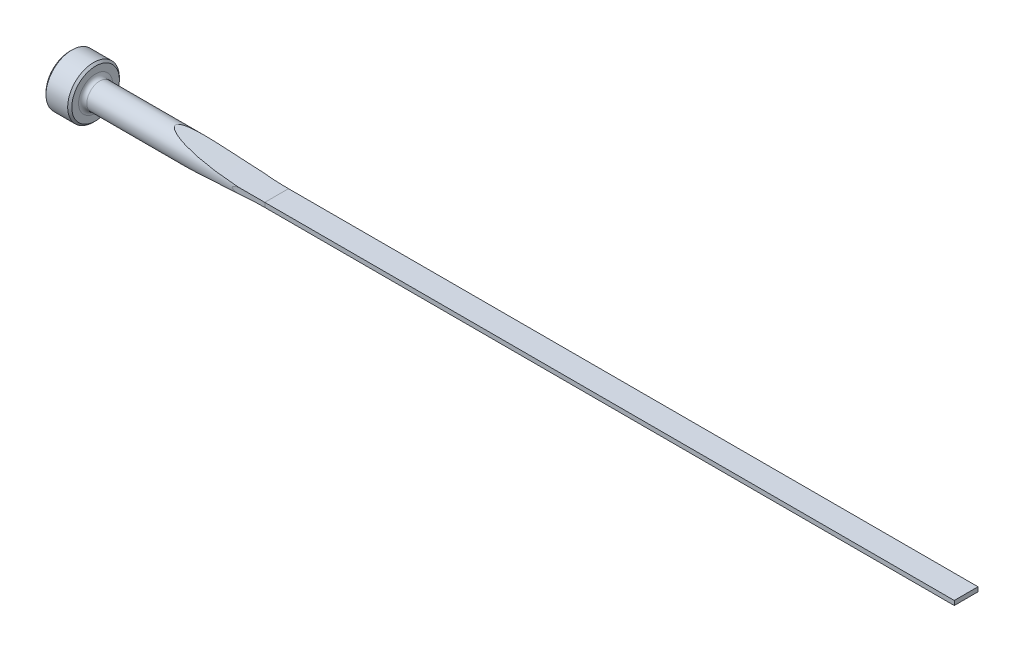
from build123d import *

# Parameters (mm, degrees)
CUT_EXTRUDE1_DEPTH = 166.237322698
CUT_EXTRUDE2_DEPTH = 166.237322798
FILLET1_R          = 0.762
CHAMFER1_SIZE      = 0.381


with BuildPart() as part:
    # Sketch1 → Revolve1 (revolve)
    with BuildSketch(Plane.XY, mode=Mode.PRIVATE) as revolve1_sk:
        Polygon((0, 0), (0, 4.7625), (4.7498, 4.7625), (4.7498, 2.3749), (165.1, 2.3749), (165.1, 0), align=None)
    revolve(revolve1_sk.sketch.rotate(Axis((0, 0, 0), (1, 0, 0)), 90), axis=Axis((0, 0, 0), (1, 0, 0)))

    # Sketch2 → Cut-Extrude1 (cut, symmetric)
    with BuildSketch(Plane.XY):
        with BuildLine():
            Line((165.1, 2.3749), (165.1, 0.4064))
            Line((165.1, 0.4064), (38.1, 0.4064))
            ThreePointArc((38.1, 0.4064), (28.745865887, 0.899894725), (19.495583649, 2.3749))
            Line((19.495583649, 2.3749), (165.1, 2.3749))
        make_face()
    cut_extrude1 = extrude(amount=CUT_EXTRUDE1_DEPTH, both=True, mode=Mode.SUBTRACT)

    # Mirror1: Cut-Extrude1 across plane
    add(cut_extrude1.mirror(Plane.ZX), mode=Mode.SUBTRACT)

    # Sketch3 → Cut-Extrude2 (cut, symmetric)
    with BuildSketch(Plane(origin=(0, 0, 0), x_dir=(1, 0, 0), z_dir=(0, 1, 0))):
        with BuildLine():
            Line((165.1, 2.3749), (165.1, 2.1844))
            Line((165.1, 2.1844), (38.1, 2.1844))
            ThreePointArc((38.1, 2.1844), (35.190064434, 2.232037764), (32.283247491, 2.3749))
            Line((32.283247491, 2.3749), (165.1, 2.3749))
        make_face()
    cut_extrude2 = extrude(amount=CUT_EXTRUDE2_DEPTH, both=True, mode=Mode.SUBTRACT)

    # Mirror2: Cut-Extrude2 across plane
    add(cut_extrude2.mirror(Plane.XY), mode=Mode.SUBTRACT)

    # Fillet1
    fillet1_edges = [part.edges().sort_by_distance(p)[0] for p in [
        (4.7498, 0, -2.3749),
    ]]
    fillet(fillet1_edges, radius=FILLET1_R)

    # Chamfer1
    chamfer1_edges = [part.edges().sort_by_distance(p)[0] for p in [
        (4.7498, 0, -4.7625),
        (0, 0, -4.7625),
    ]]
    chamfer(chamfer1_edges, length=CHAMFER1_SIZE)


solid = part.part
